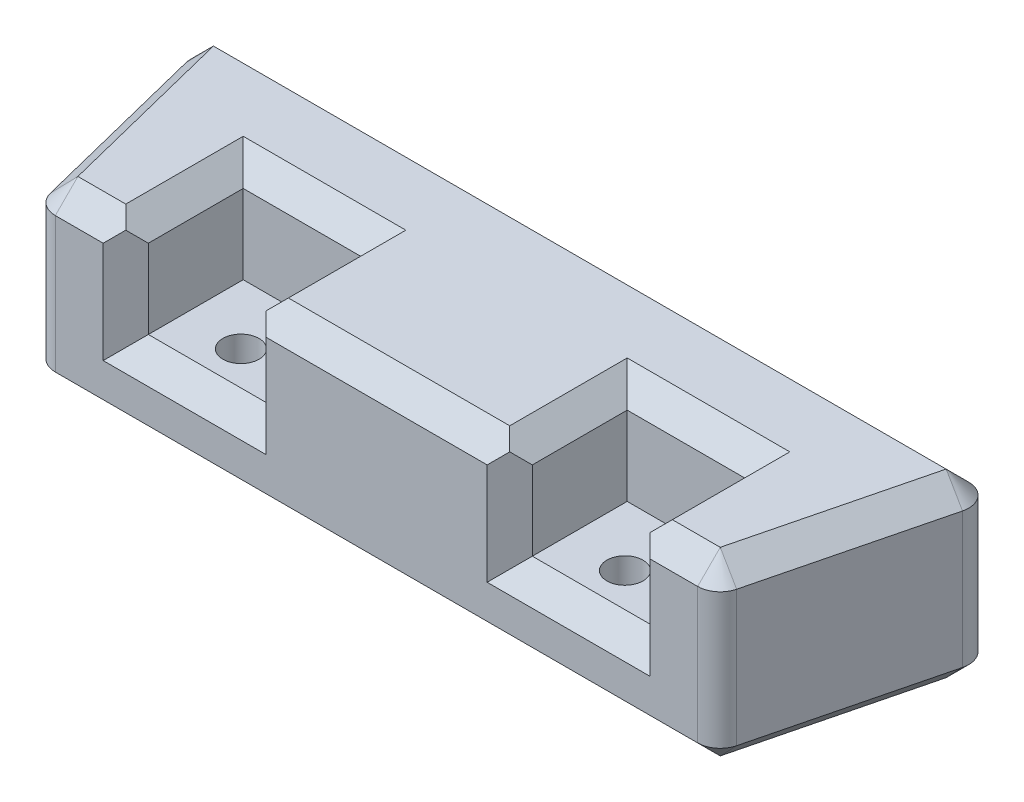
ISO-10303-21;
HEADER;
FILE_DESCRIPTION(('STEP AP214'),'2;1');
FILE_NAME('part.step','',(''),(''),'','','');
FILE_SCHEMA(('AUTOMOTIVE_DESIGN { 1 0 10303 214 1 1 1 1 }'));
ENDSEC;
DATA;
#1=APPLICATION_CONTEXT('core data for automotive mechanical design processes');
#2=APPLICATION_PROTOCOL_DEFINITION('international standard','automotive_design',2000,#1);
#3=PRODUCT_CONTEXT('',#1,'mechanical');
#4=PRODUCT('Part','Part','',(#3));
#5=PRODUCT_RELATED_PRODUCT_CATEGORY('part','',(#4));
#6=PRODUCT_DEFINITION_FORMATION('','',#4);
#7=PRODUCT_DEFINITION_CONTEXT('part definition',#1,'design');
#8=PRODUCT_DEFINITION('design','',#6,#7);
#9=PRODUCT_DEFINITION_SHAPE('','',#8);
#10=(LENGTH_UNIT() NAMED_UNIT(*) SI_UNIT(.MILLI.,.METRE.));
#11=(NAMED_UNIT(*) PLANE_ANGLE_UNIT() SI_UNIT($,.RADIAN.));
#12=(NAMED_UNIT(*) SI_UNIT($,.STERADIAN.) SOLID_ANGLE_UNIT());
#13=UNCERTAINTY_MEASURE_WITH_UNIT(LENGTH_MEASURE(1.E-05),#10,'distance_accuracy_value','');
#14=(GEOMETRIC_REPRESENTATION_CONTEXT(3) GLOBAL_UNCERTAINTY_ASSIGNED_CONTEXT((#13)) GLOBAL_UNIT_ASSIGNED_CONTEXT((#10,
#11,#12)) REPRESENTATION_CONTEXT('',''));
#15=CARTESIAN_POINT('',(0.,0.,0.));
#16=DIRECTION('',(0.,0.,1.));
#17=DIRECTION('',(1.,0.,0.));
#18=AXIS2_PLACEMENT_3D('',#15,#16,#17);
#19=CARTESIAN_POINT('',(31.2192235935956,8.,-9.));
#20=DIRECTION('',(0.,-1.,0.));
#21=DIRECTION('',(0.,0.,-1.));
#22=AXIS2_PLACEMENT_3D('',#19,#20,#21);
#23=CYLINDRICAL_SURFACE('',#22,0.999999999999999);
#24=DIRECTION('',(0.,-1.,0.));
#25=VECTOR('',#24,1.);
#26=CARTESIAN_POINT('',(32.1893660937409,8.,-8.75746437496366));
#27=LINE('',#26,#25);
#28=CARTESIAN_POINT('',(32.1893660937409,7.00000000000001,-8.75746437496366));
#29=VERTEX_POINT('',#28);
#30=CARTESIAN_POINT('',(32.1893660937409,0.999999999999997,-8.75746437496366));
#31=VERTEX_POINT('',#30);
#32=EDGE_CURVE('E277',#29,#31,#27,.T.);
#33=ORIENTED_EDGE('',*,*,#32,.T.);
#34=CARTESIAN_POINT('',(31.2192235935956,0.999999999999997,-9.));
#35=DIRECTION('',(0.,1.,0.));
#36=DIRECTION('',(0.,0.,1.));
#37=AXIS2_PLACEMENT_3D('',#34,#35,#36);
#38=CIRCLE('',#37,0.999999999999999);
#39=CARTESIAN_POINT('',(31.2192235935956,0.999999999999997,-10.));
#40=VERTEX_POINT('',#39);
#41=EDGE_CURVE('E500',#31,#40,#38,.T.);
#42=ORIENTED_EDGE('',*,*,#41,.T.);
#43=DIRECTION('',(0.,-1.,0.));
#44=VECTOR('',#43,1.);
#45=CARTESIAN_POINT('',(31.2192235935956,8.,-10.));
#46=LINE('',#45,#44);
#47=CARTESIAN_POINT('',(31.2192235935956,7.00000000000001,-10.));
#48=VERTEX_POINT('',#47);
#49=EDGE_CURVE('E329',#48,#40,#46,.T.);
#50=ORIENTED_EDGE('',*,*,#49,.F.);
#51=CARTESIAN_POINT('',(31.2192235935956,7.00000000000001,-9.));
#52=DIRECTION('',(0.,1.,0.));
#53=DIRECTION('',(0.,0.,1.));
#54=AXIS2_PLACEMENT_3D('',#51,#52,#53);
#55=CIRCLE('',#54,0.999999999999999);
#56=EDGE_CURVE('E408',#48,#29,#55,.F.);
#57=ORIENTED_EDGE('',*,*,#56,.T.);
#58=EDGE_LOOP('',(#33,#42,#50,#57));
#59=FACE_BOUND('',#58,.T.);
#60=ADVANCED_FACE('F47',(#59),#23,.T.);
#61=CARTESIAN_POINT('',(-1.21922359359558,8.,-10.));
#62=DIRECTION('',(0.,0.,1.));
#63=DIRECTION('',(1.,0.,0.));
#64=AXIS2_PLACEMENT_3D('',#61,#62,#63);
#65=PLANE('',#64);
#66=ORIENTED_EDGE('',*,*,#49,.T.);
#67=DIRECTION('',(-1.,0.,0.));
#68=VECTOR('',#67,1.);
#69=CARTESIAN_POINT('',(-1.21922359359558,0.999999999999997,-10.));
#70=LINE('',#69,#68);
#71=CARTESIAN_POINT('',(-1.21922359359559,0.999999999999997,-10.));
#72=VERTEX_POINT('',#71);
#73=EDGE_CURVE('E420',#40,#72,#70,.T.);
#74=ORIENTED_EDGE('',*,*,#73,.T.);
#75=DIRECTION('',(0.,-1.,0.));
#76=VECTOR('',#75,1.);
#77=CARTESIAN_POINT('',(-1.21922359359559,8.,-10.));
#78=LINE('',#77,#76);
#79=CARTESIAN_POINT('',(-1.21922359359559,7.00000000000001,-10.));
#80=VERTEX_POINT('',#79);
#81=EDGE_CURVE('E325',#80,#72,#78,.T.);
#82=ORIENTED_EDGE('',*,*,#81,.F.);
#83=DIRECTION('',(1.,0.,0.));
#84=VECTOR('',#83,1.);
#85=CARTESIAN_POINT('',(31.2192235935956,7.00000000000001,-10.));
#86=LINE('',#85,#84);
#87=EDGE_CURVE('E405',#80,#48,#86,.T.);
#88=ORIENTED_EDGE('',*,*,#87,.T.);
#89=EDGE_LOOP('',(#66,#74,#82,#88));
#90=FACE_BOUND('',#89,.T.);
#91=ADVANCED_FACE('F655',(#90),#65,.F.);
#92=CARTESIAN_POINT('',(-1.21922359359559,8.,-9.));
#93=DIRECTION('',(0.,-1.,0.));
#94=DIRECTION('',(0.,0.,-1.));
#95=AXIS2_PLACEMENT_3D('',#92,#93,#94);
#96=CYLINDRICAL_SURFACE('',#95,1.);
#97=ORIENTED_EDGE('',*,*,#81,.T.);
#98=CARTESIAN_POINT('',(-1.21922359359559,0.999999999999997,-9.));
#99=DIRECTION('',(0.,1.,0.));
#100=DIRECTION('',(0.,0.,1.));
#101=AXIS2_PLACEMENT_3D('',#98,#99,#100);
#102=CIRCLE('',#101,1.);
#103=CARTESIAN_POINT('',(-2.18936609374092,0.999999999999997,-8.75746437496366));
#104=VERTEX_POINT('',#103);
#105=EDGE_CURVE('E497',#72,#104,#102,.T.);
#106=ORIENTED_EDGE('',*,*,#105,.T.);
#107=DIRECTION('',(0.,-1.,0.));
#108=VECTOR('',#107,1.);
#109=CARTESIAN_POINT('',(-2.18936609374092,8.,-8.75746437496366));
#110=LINE('',#109,#108);
#111=CARTESIAN_POINT('',(-2.18936609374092,7.00000000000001,-8.75746437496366));
#112=VERTEX_POINT('',#111);
#113=EDGE_CURVE('E321',#112,#104,#110,.T.);
#114=ORIENTED_EDGE('',*,*,#113,.F.);
#115=CARTESIAN_POINT('',(-1.21922359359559,7.00000000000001,-9.));
#116=DIRECTION('',(0.,1.,0.));
#117=DIRECTION('',(0.,0.,1.));
#118=AXIS2_PLACEMENT_3D('',#115,#116,#117);
#119=CIRCLE('',#118,1.);
#120=EDGE_CURVE('E402',#112,#80,#119,.F.);
#121=ORIENTED_EDGE('',*,*,#120,.T.);
#122=EDGE_LOOP('',(#97,#106,#114,#121));
#123=FACE_BOUND('',#122,.T.);
#124=ADVANCED_FACE('F661',(#123),#96,.T.);
#125=CARTESIAN_POINT('',(-0.189366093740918,8.,-0.757464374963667));
#126=DIRECTION('',(0.970142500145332,0.,-0.242535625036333));
#127=DIRECTION('',(-0.242535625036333,0.,-0.970142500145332));
#128=AXIS2_PLACEMENT_3D('',#125,#126,#127);
#129=PLANE('',#128);
#130=ORIENTED_EDGE('',*,*,#113,.T.);
#131=DIRECTION('',(0.242535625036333,0.,0.970142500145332));
#132=VECTOR('',#131,1.);
#133=CARTESIAN_POINT('',(-0.189366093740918,0.999999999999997,-0.757464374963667));
#134=LINE('',#133,#132);
#135=CARTESIAN_POINT('',(-0.189366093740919,0.999999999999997,-0.757464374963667));
#136=VERTEX_POINT('',#135);
#137=EDGE_CURVE('E503',#104,#136,#134,.T.);
#138=ORIENTED_EDGE('',*,*,#137,.T.);
#139=DIRECTION('',(0.,-1.,0.));
#140=VECTOR('',#139,1.);
#141=CARTESIAN_POINT('',(-0.189366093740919,8.,-0.757464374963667));
#142=LINE('',#141,#140);
#143=CARTESIAN_POINT('',(-0.189366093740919,7.00000000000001,-0.757464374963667));
#144=VERTEX_POINT('',#143);
#145=EDGE_CURVE('E317',#144,#136,#142,.T.);
#146=ORIENTED_EDGE('',*,*,#145,.F.);
#147=DIRECTION('',(-0.242535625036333,0.,-0.970142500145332));
#148=VECTOR('',#147,1.);
#149=CARTESIAN_POINT('',(-2.18936609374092,7.00000000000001,-8.75746437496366));
#150=LINE('',#149,#148);
#151=EDGE_CURVE('E399',#144,#112,#150,.T.);
#152=ORIENTED_EDGE('',*,*,#151,.T.);
#153=EDGE_LOOP('',(#130,#138,#146,#152));
#154=FACE_BOUND('',#153,.T.);
#155=ADVANCED_FACE('F882',(#154),#129,.F.);
#156=CARTESIAN_POINT('',(0.780776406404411,8.,-1.));
#157=DIRECTION('',(0.,-1.,0.));
#158=DIRECTION('',(0.,0.,-1.));
#159=AXIS2_PLACEMENT_3D('',#156,#157,#158);
#160=CYLINDRICAL_SURFACE('',#159,0.999999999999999);
#161=ORIENTED_EDGE('',*,*,#145,.T.);
#162=CARTESIAN_POINT('',(0.780776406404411,0.999999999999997,-1.));
#163=DIRECTION('',(0.,1.,0.));
#164=DIRECTION('',(0.,0.,1.));
#165=AXIS2_PLACEMENT_3D('',#162,#163,#164);
#166=CIRCLE('',#165,0.999999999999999);
#167=CARTESIAN_POINT('',(0.78077640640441,0.999999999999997,0.));
#168=VERTEX_POINT('',#167);
#169=EDGE_CURVE('E506',#136,#168,#166,.T.);
#170=ORIENTED_EDGE('',*,*,#169,.T.);
#171=DIRECTION('',(0.,-1.,0.));
#172=VECTOR('',#171,1.);
#173=CARTESIAN_POINT('',(0.78077640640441,8.,0.));
#174=LINE('',#173,#172);
#175=CARTESIAN_POINT('',(0.78077640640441,7.00000000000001,0.));
#176=VERTEX_POINT('',#175);
#177=EDGE_CURVE('E313',#176,#168,#174,.T.);
#178=ORIENTED_EDGE('',*,*,#177,.F.);
#179=CARTESIAN_POINT('',(0.780776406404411,7.00000000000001,-1.));
#180=DIRECTION('',(0.,1.,0.));
#181=DIRECTION('',(0.,0.,1.));
#182=AXIS2_PLACEMENT_3D('',#179,#180,#181);
#183=CIRCLE('',#182,0.999999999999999);
#184=EDGE_CURVE('E396',#176,#144,#183,.F.);
#185=ORIENTED_EDGE('',*,*,#184,.T.);
#186=EDGE_LOOP('',(#161,#170,#178,#185));
#187=FACE_BOUND('',#186,.T.);
#188=ADVANCED_FACE('F878',(#187),#160,.T.);
#189=CARTESIAN_POINT('',(29.2192235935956,8.,0.));
#190=DIRECTION('',(0.,0.,-1.));
#191=DIRECTION('',(-1.,0.,0.));
#192=AXIS2_PLACEMENT_3D('',#189,#190,#191);
#193=PLANE('',#192);
#194=ORIENTED_EDGE('',*,*,#177,.T.);
#195=DIRECTION('',(1.,0.,0.));
#196=VECTOR('',#195,1.);
#197=CARTESIAN_POINT('',(29.2192235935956,0.999999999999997,0.));
#198=LINE('',#197,#196);
#199=CARTESIAN_POINT('',(29.2192235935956,0.999999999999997,0.));
#200=VERTEX_POINT('',#199);
#201=EDGE_CURVE('E533',#168,#200,#198,.T.);
#202=ORIENTED_EDGE('',*,*,#201,.T.);
#203=DIRECTION('',(0.,-1.,0.));
#204=VECTOR('',#203,1.);
#205=CARTESIAN_POINT('',(29.2192235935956,8.,0.));
#206=LINE('',#205,#204);
#207=CARTESIAN_POINT('',(29.2192235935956,7.00000000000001,0.));
#208=VERTEX_POINT('',#207);
#209=EDGE_CURVE('E309',#208,#200,#206,.T.);
#210=ORIENTED_EDGE('',*,*,#209,.F.);
#211=DIRECTION('',(-1.,0.,0.));
#212=VECTOR('',#211,1.);
#213=CARTESIAN_POINT('',(26.1,7.00000000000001,0.));
#214=LINE('',#213,#212);
#215=CARTESIAN_POINT('',(27.1,7.00000000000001,0.));
#216=VERTEX_POINT('',#215);
#217=EDGE_CURVE('E376',#208,#216,#214,.T.);
#218=ORIENTED_EDGE('',*,*,#217,.T.);
#219=DIRECTION('',(0.,-1.,0.));
#220=VECTOR('',#219,1.);
#221=CARTESIAN_POINT('',(27.1,8.,0.));
#222=LINE('',#221,#220);
#223=CARTESIAN_POINT('',(27.1,2.5,0.));
#224=VERTEX_POINT('',#223);
#225=EDGE_CURVE('E530',#216,#224,#222,.T.);
#226=ORIENTED_EDGE('',*,*,#225,.T.);
#227=DIRECTION('',(-1.,0.,0.));
#228=VECTOR('',#227,1.);
#229=CARTESIAN_POINT('',(20.9,2.5,0.));
#230=LINE('',#229,#228);
#231=CARTESIAN_POINT('',(19.9,2.5,0.));
#232=VERTEX_POINT('',#231);
#233=EDGE_CURVE('E527',#224,#232,#230,.T.);
#234=ORIENTED_EDGE('',*,*,#233,.T.);
#235=DIRECTION('',(0.,1.,0.));
#236=VECTOR('',#235,1.);
#237=CARTESIAN_POINT('',(19.9,8.,0.));
#238=LINE('',#237,#236);
#239=CARTESIAN_POINT('',(19.9,7.00000000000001,0.));
#240=VERTEX_POINT('',#239);
#241=EDGE_CURVE('E524',#232,#240,#238,.T.);
#242=ORIENTED_EDGE('',*,*,#241,.T.);
#243=DIRECTION('',(-1.,0.,0.));
#244=VECTOR('',#243,1.);
#245=CARTESIAN_POINT('',(9.1,7.00000000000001,0.));
#246=LINE('',#245,#244);
#247=CARTESIAN_POINT('',(10.1,7.00000000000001,0.));
#248=VERTEX_POINT('',#247);
#249=EDGE_CURVE('E383',#240,#248,#246,.T.);
#250=ORIENTED_EDGE('',*,*,#249,.T.);
#251=DIRECTION('',(0.,-1.,0.));
#252=VECTOR('',#251,1.);
#253=CARTESIAN_POINT('',(10.1,8.,0.));
#254=LINE('',#253,#252);
#255=CARTESIAN_POINT('',(10.1,2.5,0.));
#256=VERTEX_POINT('',#255);
#257=EDGE_CURVE('E521',#248,#256,#254,.T.);
#258=ORIENTED_EDGE('',*,*,#257,.T.);
#259=DIRECTION('',(-1.,0.,0.));
#260=VECTOR('',#259,1.);
#261=CARTESIAN_POINT('',(3.9,2.5,0.));
#262=LINE('',#261,#260);
#263=CARTESIAN_POINT('',(2.9,2.5,0.));
#264=VERTEX_POINT('',#263);
#265=EDGE_CURVE('E518',#256,#264,#262,.T.);
#266=ORIENTED_EDGE('',*,*,#265,.T.);
#267=DIRECTION('',(0.,1.,0.));
#268=VECTOR('',#267,1.);
#269=CARTESIAN_POINT('',(2.9,8.,0.));
#270=LINE('',#269,#268);
#271=CARTESIAN_POINT('',(2.9,7.00000000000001,0.));
#272=VERTEX_POINT('',#271);
#273=EDGE_CURVE('E515',#264,#272,#270,.T.);
#274=ORIENTED_EDGE('',*,*,#273,.T.);
#275=DIRECTION('',(-1.,0.,0.));
#276=VECTOR('',#275,1.);
#277=CARTESIAN_POINT('',(0.78077640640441,7.00000000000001,0.));
#278=LINE('',#277,#276);
#279=EDGE_CURVE('E380',#272,#176,#278,.T.);
#280=ORIENTED_EDGE('',*,*,#279,.T.);
#281=EDGE_LOOP('',(#194,#202,#210,#218,#226,#234,#242,#250,#258,#266,#274,#280));
#282=FACE_BOUND('',#281,.T.);
#283=ADVANCED_FACE('F870',(#282),#193,.F.);
#284=CARTESIAN_POINT('',(29.2192235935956,8.,-1.));
#285=DIRECTION('',(0.,-1.,0.));
#286=DIRECTION('',(0.,0.,-1.));
#287=AXIS2_PLACEMENT_3D('',#284,#285,#286);
#288=CYLINDRICAL_SURFACE('',#287,0.999999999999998);
#289=ORIENTED_EDGE('',*,*,#209,.T.);
#290=CARTESIAN_POINT('',(29.2192235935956,0.999999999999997,-1.));
#291=DIRECTION('',(0.,1.,0.));
#292=DIRECTION('',(0.,0.,1.));
#293=AXIS2_PLACEMENT_3D('',#290,#291,#292);
#294=CIRCLE('',#293,0.999999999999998);
#295=CARTESIAN_POINT('',(30.1893660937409,0.999999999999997,-0.757464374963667));
#296=VERTEX_POINT('',#295);
#297=EDGE_CURVE('E512',#200,#296,#294,.T.);
#298=ORIENTED_EDGE('',*,*,#297,.T.);
#299=DIRECTION('',(0.,-1.,0.));
#300=VECTOR('',#299,1.);
#301=CARTESIAN_POINT('',(30.1893660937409,8.,-0.757464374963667));
#302=LINE('',#301,#300);
#303=CARTESIAN_POINT('',(30.1893660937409,7.00000000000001,-0.757464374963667));
#304=VERTEX_POINT('',#303);
#305=EDGE_CURVE('E282',#304,#296,#302,.T.);
#306=ORIENTED_EDGE('',*,*,#305,.F.);
#307=CARTESIAN_POINT('',(29.2192235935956,7.00000000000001,-1.));
#308=DIRECTION('',(0.,1.,0.));
#309=DIRECTION('',(0.,0.,1.));
#310=AXIS2_PLACEMENT_3D('',#307,#308,#309);
#311=CIRCLE('',#310,0.999999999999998);
#312=EDGE_CURVE('E414',#304,#208,#311,.F.);
#313=ORIENTED_EDGE('',*,*,#312,.T.);
#314=EDGE_LOOP('',(#289,#298,#306,#313));
#315=FACE_BOUND('',#314,.T.);
#316=ADVANCED_FACE('F911',(#315),#288,.T.);
#317=CARTESIAN_POINT('',(32.1893660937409,8.,-8.75746437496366));
#318=DIRECTION('',(-0.970142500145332,0.,-0.242535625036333));
#319=DIRECTION('',(-0.242535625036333,0.,0.970142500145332));
#320=AXIS2_PLACEMENT_3D('',#317,#318,#319);
#321=PLANE('',#320);
#322=ORIENTED_EDGE('',*,*,#305,.T.);
#323=DIRECTION('',(0.242535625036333,0.,-0.970142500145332));
#324=VECTOR('',#323,1.);
#325=CARTESIAN_POINT('',(32.1893660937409,0.999999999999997,-8.75746437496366));
#326=LINE('',#325,#324);
#327=EDGE_CURVE('E509',#296,#31,#326,.T.);
#328=ORIENTED_EDGE('',*,*,#327,.T.);
#329=ORIENTED_EDGE('',*,*,#32,.F.);
#330=DIRECTION('',(-0.242535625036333,0.,0.970142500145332));
#331=VECTOR('',#330,1.);
#332=CARTESIAN_POINT('',(30.1893660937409,7.00000000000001,-0.757464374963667));
#333=LINE('',#332,#331);
#334=EDGE_CURVE('E411',#29,#304,#333,.T.);
#335=ORIENTED_EDGE('',*,*,#334,.T.);
#336=EDGE_LOOP('',(#322,#328,#329,#335));
#337=FACE_BOUND('',#336,.T.);
#338=ADVANCED_FACE('F914',(#337),#321,.F.);
#339=CARTESIAN_POINT('',(31.2192235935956,8.,-9.));
#340=DIRECTION('',(0.,1.,0.));
#341=DIRECTION('',(0.,0.,1.));
#342=AXIS2_PLACEMENT_3D('',#339,#340,#341);
#343=PLANE('',#342);
#344=DIRECTION('',(0.,0.,-1.));
#345=VECTOR('',#344,1.);
#346=CARTESIAN_POINT('',(19.9,8.,-5.2));
#347=LINE('',#346,#345);
#348=CARTESIAN_POINT('',(19.9,8.,-0.999999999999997));
#349=VERTEX_POINT('',#348);
#350=CARTESIAN_POINT('',(19.9,8.,-6.2));
#351=VERTEX_POINT('',#350);
#352=EDGE_CURVE('E366',#349,#351,#347,.T.);
#353=ORIENTED_EDGE('',*,*,#352,.T.);
#354=DIRECTION('',(1.,0.,0.));
#355=VECTOR('',#354,1.);
#356=CARTESIAN_POINT('',(26.1,8.,-6.2));
#357=LINE('',#356,#355);
#358=CARTESIAN_POINT('',(27.1,8.,-6.2));
#359=VERTEX_POINT('',#358);
#360=EDGE_CURVE('E369',#351,#359,#357,.T.);
#361=ORIENTED_EDGE('',*,*,#360,.T.);
#362=DIRECTION('',(0.,0.,1.));
#363=VECTOR('',#362,1.);
#364=CARTESIAN_POINT('',(27.1,8.,0.));
#365=LINE('',#364,#363);
#366=CARTESIAN_POINT('',(27.1,8.,-0.999999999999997));
#367=VERTEX_POINT('',#366);
#368=EDGE_CURVE('E335',#359,#367,#365,.T.);
#369=ORIENTED_EDGE('',*,*,#368,.T.);
#370=DIRECTION('',(1.,0.,0.));
#371=VECTOR('',#370,1.);
#372=CARTESIAN_POINT('',(29.2192235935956,8.,-0.999999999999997));
#373=LINE('',#372,#371);
#374=CARTESIAN_POINT('',(29.2192235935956,8.,-0.999999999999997));
#375=VERTEX_POINT('',#374);
#376=EDGE_CURVE('E339',#367,#375,#373,.T.);
#377=ORIENTED_EDGE('',*,*,#376,.T.);
#378=DIRECTION('',(0.242535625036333,0.,-0.970142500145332));
#379=VECTOR('',#378,1.);
#380=CARTESIAN_POINT('',(31.2192235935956,8.,-8.99999999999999));
#381=LINE('',#380,#379);
#382=CARTESIAN_POINT('',(31.2192235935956,8.,-9.));
#383=VERTEX_POINT('',#382);
#384=EDGE_CURVE('E342',#375,#383,#381,.T.);
#385=ORIENTED_EDGE('',*,*,#384,.T.);
#386=DIRECTION('',(-1.,0.,0.));
#387=VECTOR('',#386,1.);
#388=CARTESIAN_POINT('',(-1.21922359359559,8.,-9.));
#389=LINE('',#388,#387);
#390=CARTESIAN_POINT('',(-1.21922359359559,8.,-9.));
#391=VERTEX_POINT('',#390);
#392=EDGE_CURVE('E345',#383,#391,#389,.T.);
#393=ORIENTED_EDGE('',*,*,#392,.T.);
#394=DIRECTION('',(0.242535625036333,0.,0.970142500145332));
#395=VECTOR('',#394,1.);
#396=CARTESIAN_POINT('',(0.780776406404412,8.,-1.));
#397=LINE('',#396,#395);
#398=CARTESIAN_POINT('',(0.780776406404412,8.,-1.));
#399=VERTEX_POINT('',#398);
#400=EDGE_CURVE('E348',#391,#399,#397,.T.);
#401=ORIENTED_EDGE('',*,*,#400,.T.);
#402=DIRECTION('',(1.,0.,0.));
#403=VECTOR('',#402,1.);
#404=CARTESIAN_POINT('',(3.9,8.,-0.999999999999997));
#405=LINE('',#404,#403);
#406=CARTESIAN_POINT('',(2.9,8.,-0.999999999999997));
#407=VERTEX_POINT('',#406);
#408=EDGE_CURVE('E351',#399,#407,#405,.T.);
#409=ORIENTED_EDGE('',*,*,#408,.T.);
#410=DIRECTION('',(0.,0.,-1.));
#411=VECTOR('',#410,1.);
#412=CARTESIAN_POINT('',(2.9,8.,-5.2));
#413=LINE('',#412,#411);
#414=CARTESIAN_POINT('',(2.9,8.,-6.2));
#415=VERTEX_POINT('',#414);
#416=EDGE_CURVE('E354',#407,#415,#413,.T.);
#417=ORIENTED_EDGE('',*,*,#416,.T.);
#418=DIRECTION('',(1.,0.,0.));
#419=VECTOR('',#418,1.);
#420=CARTESIAN_POINT('',(9.1,8.,-6.2));
#421=LINE('',#420,#419);
#422=CARTESIAN_POINT('',(10.1,8.,-6.2));
#423=VERTEX_POINT('',#422);
#424=EDGE_CURVE('E357',#415,#423,#421,.T.);
#425=ORIENTED_EDGE('',*,*,#424,.T.);
#426=DIRECTION('',(0.,0.,1.));
#427=VECTOR('',#426,1.);
#428=CARTESIAN_POINT('',(10.1,8.,0.));
#429=LINE('',#428,#427);
#430=CARTESIAN_POINT('',(10.1,8.,-0.999999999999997));
#431=VERTEX_POINT('',#430);
#432=EDGE_CURVE('E360',#423,#431,#429,.T.);
#433=ORIENTED_EDGE('',*,*,#432,.T.);
#434=DIRECTION('',(1.,0.,0.));
#435=VECTOR('',#434,1.);
#436=CARTESIAN_POINT('',(20.9,8.,-0.999999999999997));
#437=LINE('',#436,#435);
#438=EDGE_CURVE('E363',#431,#349,#437,.T.);
#439=ORIENTED_EDGE('',*,*,#438,.T.);
#440=EDGE_LOOP('',(#353,#361,#369,#377,#385,#393,#401,#409,#417,#425,#433,#439));
#441=FACE_BOUND('',#440,.T.);
#442=ADVANCED_FACE('F939',(#441),#343,.T.);
#443=CARTESIAN_POINT('',(31.2192235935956,0.,-9.));
#444=DIRECTION('',(0.,1.,0.));
#445=DIRECTION('',(0.,0.,1.));
#446=AXIS2_PLACEMENT_3D('',#443,#444,#445);
#447=PLANE('',#446);
#448=CARTESIAN_POINT('',(23.5,0.,-2.5));
#449=DIRECTION('',(0.,1.,0.));
#450=DIRECTION('',(0.,0.,1.));
#451=AXIS2_PLACEMENT_3D('',#448,#449,#450);
#452=CIRCLE('',#451,0.799999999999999);
#453=CARTESIAN_POINT('',(23.5,0.,-1.7));
#454=VERTEX_POINT('',#453);
#455=EDGE_CURVE('E628',#454,#454,#452,.T.);
#456=ORIENTED_EDGE('',*,*,#455,.T.);
#457=EDGE_LOOP('',(#456));
#458=FACE_BOUND('',#457,.T.);
#459=CARTESIAN_POINT('',(6.5,0.,-2.5));
#460=DIRECTION('',(0.,1.,0.));
#461=DIRECTION('',(0.,0.,1.));
#462=AXIS2_PLACEMENT_3D('',#459,#460,#461);
#463=CIRCLE('',#462,0.799999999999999);
#464=CARTESIAN_POINT('',(6.5,0.,-1.7));
#465=VERTEX_POINT('',#464);
#466=EDGE_CURVE('E613',#465,#465,#463,.T.);
#467=ORIENTED_EDGE('',*,*,#466,.T.);
#468=EDGE_LOOP('',(#467));
#469=FACE_BOUND('',#468,.T.);
#470=DIRECTION('',(-0.242535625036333,0.,-0.970142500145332));
#471=VECTOR('',#470,1.);
#472=CARTESIAN_POINT('',(0.688920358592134,0.,-1.36742419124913));
#473=LINE('',#472,#471);
#474=CARTESIAN_POINT('',(0.780776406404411,0.,-1.));
#475=VERTEX_POINT('',#474);
#476=CARTESIAN_POINT('',(-1.21922359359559,0.,-9.));
#477=VERTEX_POINT('',#476);
#478=EDGE_CURVE('E490',#475,#477,#473,.T.);
#479=ORIENTED_EDGE('',*,*,#478,.T.);
#480=DIRECTION('',(1.,0.,0.));
#481=VECTOR('',#480,1.);
#482=CARTESIAN_POINT('',(31.2192235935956,0.,-9.));
#483=LINE('',#482,#481);
#484=CARTESIAN_POINT('',(31.2192235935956,0.,-9.));
#485=VERTEX_POINT('',#484);
#486=EDGE_CURVE('E493',#477,#485,#483,.T.);
#487=ORIENTED_EDGE('',*,*,#486,.T.);
#488=DIRECTION('',(-0.242535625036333,0.,0.970142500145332));
#489=VECTOR('',#488,1.);
#490=CARTESIAN_POINT('',(31.2192235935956,0.,-9.));
#491=LINE('',#490,#489);
#492=CARTESIAN_POINT('',(29.2192235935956,0.,-1.));
#493=VERTEX_POINT('',#492);
#494=EDGE_CURVE('E487',#485,#493,#491,.T.);
#495=ORIENTED_EDGE('',*,*,#494,.T.);
#496=DIRECTION('',(-1.,0.,0.));
#497=VECTOR('',#496,1.);
#498=CARTESIAN_POINT('',(31.2192235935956,0.,-1.));
#499=LINE('',#498,#497);
#500=EDGE_CURVE('E484',#493,#475,#499,.T.);
#501=ORIENTED_EDGE('',*,*,#500,.T.);
#502=EDGE_LOOP('',(#479,#487,#495,#501));
#503=FACE_BOUND('',#502,.T.);
#504=ADVANCED_FACE('F952',(#458,#469,#503),#447,.F.);
#505=CARTESIAN_POINT('',(3.9,-7.3539105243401,0.));
#506=DIRECTION('',(-1.,0.,0.));
#507=DIRECTION('',(0.,0.,1.));
#508=AXIS2_PLACEMENT_3D('',#505,#506,#507);
#509=PLANE('',#508);
#510=DIRECTION('',(0.,0.,1.));
#511=VECTOR('',#510,1.);
#512=CARTESIAN_POINT('',(3.9,7.00000000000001,0.));
#513=LINE('',#512,#511);
#514=CARTESIAN_POINT('',(3.9,7.00000000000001,-5.2));
#515=VERTEX_POINT('',#514);
#516=CARTESIAN_POINT('',(3.9,7.00000000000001,-1.));
#517=VERTEX_POINT('',#516);
#518=EDGE_CURVE('E393',#515,#517,#513,.T.);
#519=ORIENTED_EDGE('',*,*,#518,.T.);
#520=DIRECTION('',(0.,-1.,0.));
#521=VECTOR('',#520,1.);
#522=CARTESIAN_POINT('',(3.9,-7.3539105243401,-1.));
#523=LINE('',#522,#521);
#524=CARTESIAN_POINT('',(3.9,3.5,-1.));
#525=VERTEX_POINT('',#524);
#526=EDGE_CURVE('E12',#517,#525,#523,.T.);
#527=ORIENTED_EDGE('',*,*,#526,.T.);
#528=DIRECTION('',(0.,0.,-1.));
#529=VECTOR('',#528,1.);
#530=CARTESIAN_POINT('',(3.9,3.5,0.));
#531=LINE('',#530,#529);
#532=CARTESIAN_POINT('',(3.9,3.5,-5.2));
#533=VERTEX_POINT('',#532);
#534=EDGE_CURVE('E295',#525,#533,#531,.T.);
#535=ORIENTED_EDGE('',*,*,#534,.T.);
#536=DIRECTION('',(0.,1.,0.));
#537=VECTOR('',#536,1.);
#538=CARTESIAN_POINT('',(3.9,-7.3539105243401,-5.2));
#539=LINE('',#538,#537);
#540=EDGE_CURVE('E292',#533,#515,#539,.T.);
#541=ORIENTED_EDGE('',*,*,#540,.T.);
#542=EDGE_LOOP('',(#519,#527,#535,#541));
#543=FACE_BOUND('',#542,.T.);
#544=ADVANCED_FACE('F954',(#543),#509,.F.);
#545=CARTESIAN_POINT('',(9.1,-7.3539105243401,-5.2));
#546=DIRECTION('',(0.,0.,-1.));
#547=DIRECTION('',(-1.,0.,0.));
#548=AXIS2_PLACEMENT_3D('',#545,#546,#547);
#549=PLANE('',#548);
#550=DIRECTION('',(0.,1.,0.));
#551=VECTOR('',#550,1.);
#552=CARTESIAN_POINT('',(9.1,-7.3539105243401,-5.2));
#553=LINE('',#552,#551);
#554=CARTESIAN_POINT('',(9.1,3.5,-5.2));
#555=VERTEX_POINT('',#554);
#556=CARTESIAN_POINT('',(9.1,7.00000000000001,-5.2));
#557=VERTEX_POINT('',#556);
#558=EDGE_CURVE('E301',#555,#557,#553,.T.);
#559=ORIENTED_EDGE('',*,*,#558,.T.);
#560=DIRECTION('',(-1.,0.,0.));
#561=VECTOR('',#560,1.);
#562=CARTESIAN_POINT('',(3.9,7.00000000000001,-5.2));
#563=LINE('',#562,#561);
#564=EDGE_CURVE('E390',#557,#515,#563,.T.);
#565=ORIENTED_EDGE('',*,*,#564,.T.);
#566=ORIENTED_EDGE('',*,*,#540,.F.);
#567=DIRECTION('',(1.,0.,0.));
#568=VECTOR('',#567,1.);
#569=CARTESIAN_POINT('',(9.1,3.5,-5.2));
#570=LINE('',#569,#568);
#571=EDGE_CURVE('E291',#533,#555,#570,.T.);
#572=ORIENTED_EDGE('',*,*,#571,.T.);
#573=EDGE_LOOP('',(#559,#565,#566,#572));
#574=FACE_BOUND('',#573,.T.);
#575=ADVANCED_FACE('F961',(#574),#549,.F.);
#576=CARTESIAN_POINT('',(9.1,-7.3539105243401,0.));
#577=DIRECTION('',(1.,0.,0.));
#578=DIRECTION('',(0.,0.,-1.));
#579=AXIS2_PLACEMENT_3D('',#576,#577,#578);
#580=PLANE('',#579);
#581=DIRECTION('',(0.,0.,1.));
#582=VECTOR('',#581,1.);
#583=CARTESIAN_POINT('',(9.1,3.5,0.));
#584=LINE('',#583,#582);
#585=CARTESIAN_POINT('',(9.1,3.5,-1.));
#586=VERTEX_POINT('',#585);
#587=EDGE_CURVE('E287',#555,#586,#584,.T.);
#588=ORIENTED_EDGE('',*,*,#587,.T.);
#589=DIRECTION('',(0.,1.,0.));
#590=VECTOR('',#589,1.);
#591=CARTESIAN_POINT('',(9.1,-7.3539105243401,-1.));
#592=LINE('',#591,#590);
#593=CARTESIAN_POINT('',(9.1,7.00000000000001,-1.));
#594=VERTEX_POINT('',#593);
#595=EDGE_CURVE('E560',#586,#594,#592,.T.);
#596=ORIENTED_EDGE('',*,*,#595,.T.);
#597=DIRECTION('',(0.,0.,-1.));
#598=VECTOR('',#597,1.);
#599=CARTESIAN_POINT('',(9.1,7.00000000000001,-5.2));
#600=LINE('',#599,#598);
#601=EDGE_CURVE('E387',#594,#557,#600,.T.);
#602=ORIENTED_EDGE('',*,*,#601,.T.);
#603=ORIENTED_EDGE('',*,*,#558,.F.);
#604=EDGE_LOOP('',(#588,#596,#602,#603));
#605=FACE_BOUND('',#604,.T.);
#606=ADVANCED_FACE('F1015',(#605),#580,.F.);
#607=CARTESIAN_POINT('',(31.2192235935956,3.5,-9.));
#608=DIRECTION('',(0.,1.,0.));
#609=DIRECTION('',(0.,0.,1.));
#610=AXIS2_PLACEMENT_3D('',#607,#608,#609);
#611=PLANE('',#610);
#612=CARTESIAN_POINT('',(6.5,3.5,-2.5));
#613=DIRECTION('',(0.,1.,0.));
#614=DIRECTION('',(0.,0.,1.));
#615=AXIS2_PLACEMENT_3D('',#612,#613,#614);
#616=CIRCLE('',#615,0.799999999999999);
#617=CARTESIAN_POINT('',(6.5,3.5,-1.7));
#618=VERTEX_POINT('',#617);
#619=EDGE_CURVE('E622',#618,#618,#616,.T.);
#620=ORIENTED_EDGE('',*,*,#619,.F.);
#621=EDGE_LOOP('',(#620));
#622=FACE_BOUND('',#621,.T.);
#623=ORIENTED_EDGE('',*,*,#534,.F.);
#624=DIRECTION('',(1.,0.,0.));
#625=VECTOR('',#624,1.);
#626=CARTESIAN_POINT('',(9.1,3.5,-1.));
#627=LINE('',#626,#625);
#628=EDGE_CURVE('E567',#525,#586,#627,.T.);
#629=ORIENTED_EDGE('',*,*,#628,.T.);
#630=ORIENTED_EDGE('',*,*,#587,.F.);
#631=ORIENTED_EDGE('',*,*,#571,.F.);
#632=EDGE_LOOP('',(#623,#629,#630,#631));
#633=FACE_BOUND('',#632,.T.);
#634=ADVANCED_FACE('F1178',(#622,#633),#611,.T.);
#635=CARTESIAN_POINT('',(26.1,-7.3539105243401,0.));
#636=DIRECTION('',(1.,0.,0.));
#637=DIRECTION('',(0.,0.,-1.));
#638=AXIS2_PLACEMENT_3D('',#635,#636,#637);
#639=PLANE('',#638);
#640=DIRECTION('',(0.,0.,1.));
#641=VECTOR('',#640,1.);
#642=CARTESIAN_POINT('',(26.1,3.5,0.));
#643=LINE('',#642,#641);
#644=CARTESIAN_POINT('',(26.1,3.5,-5.2));
#645=VERTEX_POINT('',#644);
#646=CARTESIAN_POINT('',(26.1,3.5,-1.));
#647=VERTEX_POINT('',#646);
#648=EDGE_CURVE('E260',#645,#647,#643,.T.);
#649=ORIENTED_EDGE('',*,*,#648,.T.);
#650=DIRECTION('',(0.,1.,0.));
#651=VECTOR('',#650,1.);
#652=CARTESIAN_POINT('',(26.1,-7.3539105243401,-1.));
#653=LINE('',#652,#651);
#654=CARTESIAN_POINT('',(26.1,7.00000000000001,-1.));
#655=VERTEX_POINT('',#654);
#656=EDGE_CURVE('E536',#647,#655,#653,.T.);
#657=ORIENTED_EDGE('',*,*,#656,.T.);
#658=DIRECTION('',(0.,0.,-1.));
#659=VECTOR('',#658,1.);
#660=CARTESIAN_POINT('',(26.1,7.00000000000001,-5.2));
#661=LINE('',#660,#659);
#662=CARTESIAN_POINT('',(26.1,7.00000000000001,-5.2));
#663=VERTEX_POINT('',#662);
#664=EDGE_CURVE('E417',#655,#663,#661,.T.);
#665=ORIENTED_EDGE('',*,*,#664,.T.);
#666=DIRECTION('',(0.,1.,0.));
#667=VECTOR('',#666,1.);
#668=CARTESIAN_POINT('',(26.1,-7.3539105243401,-5.2));
#669=LINE('',#668,#667);
#670=EDGE_CURVE('E271',#645,#663,#669,.T.);
#671=ORIENTED_EDGE('',*,*,#670,.F.);
#672=EDGE_LOOP('',(#649,#657,#665,#671));
#673=FACE_BOUND('',#672,.T.);
#674=ADVANCED_FACE('F1184',(#673),#639,.F.);
#675=CARTESIAN_POINT('',(20.9,-7.3539105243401,0.));
#676=DIRECTION('',(-1.,0.,0.));
#677=DIRECTION('',(0.,0.,1.));
#678=AXIS2_PLACEMENT_3D('',#675,#676,#677);
#679=PLANE('',#678);
#680=DIRECTION('',(0.,0.,1.));
#681=VECTOR('',#680,1.);
#682=CARTESIAN_POINT('',(20.9,7.00000000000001,0.));
#683=LINE('',#682,#681);
#684=CARTESIAN_POINT('',(20.9,7.00000000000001,-5.2));
#685=VERTEX_POINT('',#684);
#686=CARTESIAN_POINT('',(20.9,7.00000000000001,-1.));
#687=VERTEX_POINT('',#686);
#688=EDGE_CURVE('E373',#685,#687,#683,.T.);
#689=ORIENTED_EDGE('',*,*,#688,.T.);
#690=DIRECTION('',(0.,-1.,0.));
#691=VECTOR('',#690,1.);
#692=CARTESIAN_POINT('',(20.9,-7.3539105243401,-1.));
#693=LINE('',#692,#691);
#694=CARTESIAN_POINT('',(20.9,3.5,-1.));
#695=VERTEX_POINT('',#694);
#696=EDGE_CURVE('E255',#687,#695,#693,.T.);
#697=ORIENTED_EDGE('',*,*,#696,.T.);
#698=DIRECTION('',(0.,0.,-1.));
#699=VECTOR('',#698,1.);
#700=CARTESIAN_POINT('',(20.9,3.5,0.));
#701=LINE('',#700,#699);
#702=CARTESIAN_POINT('',(20.9,3.5,-5.2));
#703=VERTEX_POINT('',#702);
#704=EDGE_CURVE('E249',#695,#703,#701,.T.);
#705=ORIENTED_EDGE('',*,*,#704,.T.);
#706=DIRECTION('',(0.,1.,0.));
#707=VECTOR('',#706,1.);
#708=CARTESIAN_POINT('',(20.9,-7.3539105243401,-5.2));
#709=LINE('',#708,#707);
#710=EDGE_CURVE('E253',#703,#685,#709,.T.);
#711=ORIENTED_EDGE('',*,*,#710,.T.);
#712=EDGE_LOOP('',(#689,#697,#705,#711));
#713=FACE_BOUND('',#712,.T.);
#714=ADVANCED_FACE('F252',(#713),#679,.F.);
#715=CARTESIAN_POINT('',(20.9,-7.3539105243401,-5.2));
#716=DIRECTION('',(0.,0.,-1.));
#717=DIRECTION('',(-1.,0.,0.));
#718=AXIS2_PLACEMENT_3D('',#715,#716,#717);
#719=PLANE('',#718);
#720=ORIENTED_EDGE('',*,*,#670,.T.);
#721=DIRECTION('',(-1.,0.,0.));
#722=VECTOR('',#721,1.);
#723=CARTESIAN_POINT('',(20.9,7.00000000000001,-5.2));
#724=LINE('',#723,#722);
#725=EDGE_CURVE('E269',#663,#685,#724,.T.);
#726=ORIENTED_EDGE('',*,*,#725,.T.);
#727=ORIENTED_EDGE('',*,*,#710,.F.);
#728=DIRECTION('',(1.,0.,0.));
#729=VECTOR('',#728,1.);
#730=CARTESIAN_POINT('',(20.9,3.5,-5.2));
#731=LINE('',#730,#729);
#732=EDGE_CURVE('E266',#703,#645,#731,.T.);
#733=ORIENTED_EDGE('',*,*,#732,.T.);
#734=EDGE_LOOP('',(#720,#726,#727,#733));
#735=FACE_BOUND('',#734,.T.);
#736=ADVANCED_FACE('F265',(#735),#719,.F.);
#737=CARTESIAN_POINT('',(31.2192235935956,3.5,-9.));
#738=DIRECTION('',(0.,1.,0.));
#739=DIRECTION('',(0.,0.,1.));
#740=AXIS2_PLACEMENT_3D('',#737,#738,#739);
#741=PLANE('',#740);
#742=CARTESIAN_POINT('',(23.5,3.5,-2.5));
#743=DIRECTION('',(0.,1.,0.));
#744=DIRECTION('',(0.,0.,1.));
#745=AXIS2_PLACEMENT_3D('',#742,#743,#744);
#746=CIRCLE('',#745,0.799999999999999);
#747=CARTESIAN_POINT('',(23.5,3.5,-1.7));
#748=VERTEX_POINT('',#747);
#749=EDGE_CURVE('E634',#748,#748,#746,.T.);
#750=ORIENTED_EDGE('',*,*,#749,.F.);
#751=EDGE_LOOP('',(#750));
#752=FACE_BOUND('',#751,.T.);
#753=ORIENTED_EDGE('',*,*,#704,.F.);
#754=DIRECTION('',(1.,0.,0.));
#755=VECTOR('',#754,1.);
#756=CARTESIAN_POINT('',(26.1,3.5,-1.));
#757=LINE('',#756,#755);
#758=EDGE_CURVE('E546',#695,#647,#757,.T.);
#759=ORIENTED_EDGE('',*,*,#758,.T.);
#760=ORIENTED_EDGE('',*,*,#648,.F.);
#761=ORIENTED_EDGE('',*,*,#732,.F.);
#762=EDGE_LOOP('',(#753,#759,#760,#761));
#763=FACE_BOUND('',#762,.T.);
#764=ADVANCED_FACE('F273',(#752,#763),#741,.T.);
#765=CARTESIAN_POINT('',(0.688920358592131,8.,-1.36742419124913));
#766=DIRECTION('',(-0.685994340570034,0.707106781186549,0.171498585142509));
#767=DIRECTION('',(-0.242535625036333,0.,-0.970142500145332));
#768=AXIS2_PLACEMENT_3D('',#765,#766,#767);
#769=PLANE('',#768);
#770=DIRECTION('',(0.685994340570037,0.707106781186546,-0.171498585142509));
#771=VECTOR('',#770,1.);
#772=CARTESIAN_POINT('',(-2.18936609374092,7.00000000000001,-8.75746437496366));
#773=LINE('',#772,#771);
#774=EDGE_CURVE('E304',#112,#391,#773,.T.);
#775=ORIENTED_EDGE('',*,*,#774,.F.);
#776=ORIENTED_EDGE('',*,*,#151,.F.);
#777=DIRECTION('',(-0.685994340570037,-0.707106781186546,0.17149858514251));
#778=VECTOR('',#777,1.);
#779=CARTESIAN_POINT('',(0.780776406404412,8.,-1.));
#780=LINE('',#779,#778);
#781=EDGE_CURVE('E474',#399,#144,#780,.T.);
#782=ORIENTED_EDGE('',*,*,#781,.F.);
#783=ORIENTED_EDGE('',*,*,#400,.F.);
#784=EDGE_LOOP('',(#775,#776,#782,#783));
#785=FACE_BOUND('',#784,.T.);
#786=ADVANCED_FACE('F642',(#785),#769,.T.);
#787=CARTESIAN_POINT('',(-1.21922359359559,7.00000000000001,-9.));
#788=DIRECTION('',(0.,-1.,0.));
#789=DIRECTION('',(0.,0.,-1.));
#790=AXIS2_PLACEMENT_3D('',#787,#788,#789);
#791=CONICAL_SURFACE('',#790,0.999999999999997,0.78539816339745);
#792=ORIENTED_EDGE('',*,*,#120,.F.);
#793=ORIENTED_EDGE('',*,*,#774,.T.);
#794=DIRECTION('',(0.,0.707106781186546,0.707106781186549));
#795=VECTOR('',#794,1.);
#796=CARTESIAN_POINT('',(-1.21922359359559,7.00000000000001,-10.));
#797=LINE('',#796,#795);
#798=EDGE_CURVE('E470',#80,#391,#797,.T.);
#799=ORIENTED_EDGE('',*,*,#798,.F.);
#800=EDGE_LOOP('',(#792,#793,#799));
#801=FACE_BOUND('',#800,.T.);
#802=ADVANCED_FACE('F648',(#801),#791,.T.);
#803=CARTESIAN_POINT('',(0.780776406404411,7.00000000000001,-1.));
#804=DIRECTION('',(0.,-1.,0.));
#805=DIRECTION('',(0.,0.,-1.));
#806=AXIS2_PLACEMENT_3D('',#803,#804,#805);
#807=CONICAL_SURFACE('',#806,0.999999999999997,0.78539816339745);
#808=ORIENTED_EDGE('',*,*,#781,.T.);
#809=ORIENTED_EDGE('',*,*,#184,.F.);
#810=DIRECTION('',(0.,-0.707106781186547,0.707106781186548));
#811=VECTOR('',#810,1.);
#812=CARTESIAN_POINT('',(0.78077640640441,8.,-0.999999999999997));
#813=LINE('',#812,#811);
#814=EDGE_CURVE('E466',#399,#176,#813,.T.);
#815=ORIENTED_EDGE('',*,*,#814,.F.);
#816=EDGE_LOOP('',(#808,#809,#815));
#817=FACE_BOUND('',#816,.T.);
#818=ADVANCED_FACE('F757',(#817),#807,.T.);
#819=CARTESIAN_POINT('',(31.2192235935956,8.,-9.));
#820=DIRECTION('',(0.,0.707106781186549,-0.707106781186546));
#821=DIRECTION('',(1.,0.,0.));
#822=AXIS2_PLACEMENT_3D('',#819,#820,#821);
#823=PLANE('',#822);
#824=ORIENTED_EDGE('',*,*,#798,.T.);
#825=ORIENTED_EDGE('',*,*,#392,.F.);
#826=DIRECTION('',(0.,0.707106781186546,0.707106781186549));
#827=VECTOR('',#826,1.);
#828=CARTESIAN_POINT('',(31.2192235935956,7.00000000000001,-10.));
#829=LINE('',#828,#827);
#830=EDGE_CURVE('E462',#48,#383,#829,.T.);
#831=ORIENTED_EDGE('',*,*,#830,.F.);
#832=ORIENTED_EDGE('',*,*,#87,.F.);
#833=EDGE_LOOP('',(#824,#825,#831,#832));
#834=FACE_BOUND('',#833,.T.);
#835=ADVANCED_FACE('F751',(#834),#823,.T.);
#836=CARTESIAN_POINT('',(31.2192235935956,8.,-0.999999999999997));
#837=DIRECTION('',(0.,0.707106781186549,0.707106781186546));
#838=DIRECTION('',(-1.,0.,0.));
#839=AXIS2_PLACEMENT_3D('',#836,#837,#838);
#840=PLANE('',#839);
#841=ORIENTED_EDGE('',*,*,#279,.F.);
#842=DIRECTION('',(-0.577350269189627,-0.577350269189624,0.577350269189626));
#843=VECTOR('',#842,1.);
#844=CARTESIAN_POINT('',(13.0064078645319,17.1064078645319,-10.1064078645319));
#845=LINE('',#844,#843);
#846=CARTESIAN_POINT('',(3.4,7.5,-0.5));
#847=VERTEX_POINT('',#846);
#848=EDGE_CURVE('E73',#272,#847,#845,.F.);
#849=ORIENTED_EDGE('',*,*,#848,.T.);
#850=DIRECTION('',(-0.577350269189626,0.577350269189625,-0.577350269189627));
#851=VECTOR('',#850,1.);
#852=CARTESIAN_POINT('',(12.3397411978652,-1.43974119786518,8.43974119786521));
#853=LINE('',#852,#851);
#854=EDGE_CURVE('E459',#407,#847,#853,.F.);
#855=ORIENTED_EDGE('',*,*,#854,.F.);
#856=ORIENTED_EDGE('',*,*,#408,.F.);
#857=ORIENTED_EDGE('',*,*,#814,.T.);
#858=EDGE_LOOP('',(#841,#849,#855,#856,#857));
#859=FACE_BOUND('',#858,.T.);
#860=ADVANCED_FACE('F744',(#859),#840,.T.);
#861=CARTESIAN_POINT('',(31.2192235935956,7.00000000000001,-9.));
#862=DIRECTION('',(0.,-1.,0.));
#863=DIRECTION('',(0.,0.,-1.));
#864=AXIS2_PLACEMENT_3D('',#861,#862,#863);
#865=CONICAL_SURFACE('',#864,0.999999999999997,0.78539816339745);
#866=ORIENTED_EDGE('',*,*,#56,.F.);
#867=ORIENTED_EDGE('',*,*,#830,.T.);
#868=DIRECTION('',(-0.685994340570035,0.707106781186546,-0.171498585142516));
#869=VECTOR('',#868,1.);
#870=CARTESIAN_POINT('',(32.1893660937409,7.00000000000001,-8.75746437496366));
#871=LINE('',#870,#869);
#872=EDGE_CURVE('E455',#29,#383,#871,.T.);
#873=ORIENTED_EDGE('',*,*,#872,.F.);
#874=EDGE_LOOP('',(#866,#867,#873));
#875=FACE_BOUND('',#874,.T.);
#876=ADVANCED_FACE('F738',(#875),#865,.T.);
#877=CARTESIAN_POINT('',(3.9,7.00000000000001,0.));
#878=DIRECTION('',(0.707106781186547,0.707106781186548,0.));
#879=DIRECTION('',(0.,0.,-1.));
#880=AXIS2_PLACEMENT_3D('',#877,#878,#879);
#881=PLANE('',#880);
#882=ORIENTED_EDGE('',*,*,#854,.T.);
#883=DIRECTION('',(-0.577350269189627,0.577350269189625,0.577350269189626));
#884=VECTOR('',#883,1.);
#885=CARTESIAN_POINT('',(3.56666666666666,7.33333333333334,-0.666666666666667));
#886=LINE('',#885,#884);
#887=EDGE_CURVE('E58',#847,#517,#886,.F.);
#888=ORIENTED_EDGE('',*,*,#887,.T.);
#889=ORIENTED_EDGE('',*,*,#518,.F.);
#890=DIRECTION('',(-0.577350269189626,0.577350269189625,-0.577350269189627));
#891=VECTOR('',#890,1.);
#892=CARTESIAN_POINT('',(5.63333333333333,5.26666666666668,-3.46666666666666));
#893=LINE('',#892,#891);
#894=EDGE_CURVE('E451',#415,#515,#893,.F.);
#895=ORIENTED_EDGE('',*,*,#894,.F.);
#896=ORIENTED_EDGE('',*,*,#416,.F.);
#897=EDGE_LOOP('',(#882,#888,#889,#895,#896));
#898=FACE_BOUND('',#897,.T.);
#899=ADVANCED_FACE('F731',(#898),#881,.T.);
#900=CARTESIAN_POINT('',(31.2192235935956,8.,-9.));
#901=DIRECTION('',(0.685994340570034,0.707106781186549,0.171498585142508));
#902=DIRECTION('',(-0.242535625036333,0.,0.970142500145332));
#903=AXIS2_PLACEMENT_3D('',#900,#901,#902);
#904=PLANE('',#903);
#905=ORIENTED_EDGE('',*,*,#872,.T.);
#906=ORIENTED_EDGE('',*,*,#384,.F.);
#907=DIRECTION('',(-0.685994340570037,0.707106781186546,-0.171498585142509));
#908=VECTOR('',#907,1.);
#909=CARTESIAN_POINT('',(30.1893660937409,7.00000000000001,-0.757464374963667));
#910=LINE('',#909,#908);
#911=EDGE_CURVE('E447',#304,#375,#910,.T.);
#912=ORIENTED_EDGE('',*,*,#911,.F.);
#913=ORIENTED_EDGE('',*,*,#334,.F.);
#914=EDGE_LOOP('',(#905,#906,#912,#913));
#915=FACE_BOUND('',#914,.T.);
#916=ADVANCED_FACE('F724',(#915),#904,.T.);
#917=CARTESIAN_POINT('',(9.1,7.00000000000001,-5.2));
#918=DIRECTION('',(0.,0.707106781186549,0.707106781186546));
#919=DIRECTION('',(1.,0.,0.));
#920=AXIS2_PLACEMENT_3D('',#917,#918,#919);
#921=PLANE('',#920);
#922=ORIENTED_EDGE('',*,*,#894,.T.);
#923=ORIENTED_EDGE('',*,*,#564,.F.);
#924=DIRECTION('',(0.577350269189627,0.577350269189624,-0.577350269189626));
#925=VECTOR('',#924,1.);
#926=CARTESIAN_POINT('',(7.36666666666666,5.26666666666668,-3.46666666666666));
#927=LINE('',#926,#925);
#928=EDGE_CURVE('E443',#423,#557,#927,.F.);
#929=ORIENTED_EDGE('',*,*,#928,.F.);
#930=ORIENTED_EDGE('',*,*,#424,.F.);
#931=EDGE_LOOP('',(#922,#923,#929,#930));
#932=FACE_BOUND('',#931,.T.);
#933=ADVANCED_FACE('F717',(#932),#921,.T.);
#934=CARTESIAN_POINT('',(29.2192235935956,7.00000000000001,-1.));
#935=DIRECTION('',(0.,-1.,0.));
#936=DIRECTION('',(0.,0.,-1.));
#937=AXIS2_PLACEMENT_3D('',#934,#935,#936);
#938=CONICAL_SURFACE('',#937,0.999999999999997,0.78539816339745);
#939=ORIENTED_EDGE('',*,*,#312,.F.);
#940=ORIENTED_EDGE('',*,*,#911,.T.);
#941=DIRECTION('',(0.,0.707106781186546,-0.707106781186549));
#942=VECTOR('',#941,1.);
#943=CARTESIAN_POINT('',(29.2192235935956,7.00000000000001,0.));
#944=LINE('',#943,#942);
#945=EDGE_CURVE('E439',#208,#375,#944,.T.);
#946=ORIENTED_EDGE('',*,*,#945,.F.);
#947=EDGE_LOOP('',(#939,#940,#946));
#948=FACE_BOUND('',#947,.T.);
#949=ADVANCED_FACE('F710',(#948),#938,.T.);
#950=CARTESIAN_POINT('',(9.1,7.00000000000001,0.));
#951=DIRECTION('',(-0.707106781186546,0.707106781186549,0.));
#952=DIRECTION('',(0.,0.,1.));
#953=AXIS2_PLACEMENT_3D('',#950,#951,#952);
#954=PLANE('',#953);
#955=ORIENTED_EDGE('',*,*,#601,.F.);
#956=DIRECTION('',(-0.577350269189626,-0.577350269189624,-0.577350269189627));
#957=VECTOR('',#956,1.);
#958=CARTESIAN_POINT('',(9.43333333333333,7.33333333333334,-0.666666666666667));
#959=LINE('',#958,#957);
#960=CARTESIAN_POINT('',(9.6,7.50000000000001,-0.5));
#961=VERTEX_POINT('',#960);
#962=EDGE_CURVE('E564',#594,#961,#959,.F.);
#963=ORIENTED_EDGE('',*,*,#962,.T.);
#964=DIRECTION('',(0.577350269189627,0.577350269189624,-0.577350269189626));
#965=VECTOR('',#964,1.);
#966=CARTESIAN_POINT('',(9.1,7.00000000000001,0.));
#967=LINE('',#966,#965);
#968=EDGE_CURVE('E435',#431,#961,#967,.F.);
#969=ORIENTED_EDGE('',*,*,#968,.F.);
#970=ORIENTED_EDGE('',*,*,#432,.F.);
#971=ORIENTED_EDGE('',*,*,#928,.T.);
#972=EDGE_LOOP('',(#955,#963,#969,#970,#971));
#973=FACE_BOUND('',#972,.T.);
#974=ADVANCED_FACE('F703',(#973),#954,.T.);
#975=CARTESIAN_POINT('',(31.2192235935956,8.,-0.999999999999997));
#976=DIRECTION('',(0.,0.707106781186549,0.707106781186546));
#977=DIRECTION('',(-1.,0.,0.));
#978=AXIS2_PLACEMENT_3D('',#975,#976,#977);
#979=PLANE('',#978);
#980=DIRECTION('',(0.577350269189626,0.577350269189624,-0.577350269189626));
#981=VECTOR('',#980,1.);
#982=CARTESIAN_POINT('',(26.1,7.00000000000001,0.));
#983=LINE('',#982,#981);
#984=CARTESIAN_POINT('',(26.6,7.5,-0.5));
#985=VERTEX_POINT('',#984);
#986=EDGE_CURVE('E432',#985,#367,#983,.T.);
#987=ORIENTED_EDGE('',*,*,#986,.F.);
#988=DIRECTION('',(-0.577350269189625,0.577350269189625,-0.577350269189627));
#989=VECTOR('',#988,1.);
#990=CARTESIAN_POINT('',(27.8064078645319,6.29359213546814,0.706407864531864));
#991=LINE('',#990,#989);
#992=EDGE_CURVE('E543',#985,#216,#991,.F.);
#993=ORIENTED_EDGE('',*,*,#992,.T.);
#994=ORIENTED_EDGE('',*,*,#217,.F.);
#995=ORIENTED_EDGE('',*,*,#945,.T.);
#996=ORIENTED_EDGE('',*,*,#376,.F.);
#997=EDGE_LOOP('',(#987,#993,#994,#995,#996));
#998=FACE_BOUND('',#997,.T.);
#999=ADVANCED_FACE('F696',(#998),#979,.T.);
#1000=CARTESIAN_POINT('',(31.2192235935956,8.,-0.999999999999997));
#1001=DIRECTION('',(0.,0.707106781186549,0.707106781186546));
#1002=DIRECTION('',(-1.,0.,0.));
#1003=AXIS2_PLACEMENT_3D('',#1000,#1001,#1002);
#1004=PLANE('',#1003);
#1005=ORIENTED_EDGE('',*,*,#249,.F.);
#1006=DIRECTION('',(-0.577350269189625,-0.577350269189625,0.577350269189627));
#1007=VECTOR('',#1006,1.);
#1008=CARTESIAN_POINT('',(24.3397411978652,11.4397411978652,-4.4397411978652));
#1009=LINE('',#1008,#1007);
#1010=CARTESIAN_POINT('',(20.4,7.5,-0.499999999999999));
#1011=VERTEX_POINT('',#1010);
#1012=EDGE_CURVE('E552',#240,#1011,#1009,.F.);
#1013=ORIENTED_EDGE('',*,*,#1012,.T.);
#1014=DIRECTION('',(-0.577350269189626,0.577350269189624,-0.577350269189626));
#1015=VECTOR('',#1014,1.);
#1016=CARTESIAN_POINT('',(23.6730745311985,4.22692546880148,2.77307453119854));
#1017=LINE('',#1016,#1015);
#1018=EDGE_CURVE('E428',#349,#1011,#1017,.F.);
#1019=ORIENTED_EDGE('',*,*,#1018,.F.);
#1020=ORIENTED_EDGE('',*,*,#438,.F.);
#1021=ORIENTED_EDGE('',*,*,#968,.T.);
#1022=DIRECTION('',(-0.577350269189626,0.577350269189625,-0.577350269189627));
#1023=VECTOR('',#1022,1.);
#1024=CARTESIAN_POINT('',(16.4730745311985,0.626925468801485,6.37307453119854));
#1025=LINE('',#1024,#1023);
#1026=EDGE_CURVE('E549',#961,#248,#1025,.F.);
#1027=ORIENTED_EDGE('',*,*,#1026,.T.);
#1028=EDGE_LOOP('',(#1005,#1013,#1019,#1020,#1021,#1027));
#1029=FACE_BOUND('',#1028,.T.);
#1030=ADVANCED_FACE('F689',(#1029),#1004,.T.);
#1031=CARTESIAN_POINT('',(26.1,7.00000000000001,0.));
#1032=DIRECTION('',(-0.707106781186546,0.707106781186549,0.));
#1033=DIRECTION('',(0.,0.,1.));
#1034=AXIS2_PLACEMENT_3D('',#1031,#1032,#1033);
#1035=PLANE('',#1034);
#1036=ORIENTED_EDGE('',*,*,#664,.F.);
#1037=DIRECTION('',(-0.577350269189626,-0.577350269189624,-0.577350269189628));
#1038=VECTOR('',#1037,1.);
#1039=CARTESIAN_POINT('',(26.4333333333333,7.33333333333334,-0.666666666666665));
#1040=LINE('',#1039,#1038);
#1041=EDGE_CURVE('E540',#655,#985,#1040,.F.);
#1042=ORIENTED_EDGE('',*,*,#1041,.T.);
#1043=ORIENTED_EDGE('',*,*,#986,.T.);
#1044=ORIENTED_EDGE('',*,*,#368,.F.);
#1045=DIRECTION('',(-0.577350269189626,-0.577350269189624,0.577350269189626));
#1046=VECTOR('',#1045,1.);
#1047=CARTESIAN_POINT('',(24.3666666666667,5.26666666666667,-3.46666666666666));
#1048=LINE('',#1047,#1046);
#1049=EDGE_CURVE('E424',#663,#359,#1048,.F.);
#1050=ORIENTED_EDGE('',*,*,#1049,.F.);
#1051=EDGE_LOOP('',(#1036,#1042,#1043,#1044,#1050));
#1052=FACE_BOUND('',#1051,.T.);
#1053=ADVANCED_FACE('F682',(#1052),#1035,.T.);
#1054=CARTESIAN_POINT('',(20.9,7.00000000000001,0.));
#1055=DIRECTION('',(0.707106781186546,0.707106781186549,0.));
#1056=DIRECTION('',(0.,0.,-1.));
#1057=AXIS2_PLACEMENT_3D('',#1054,#1055,#1056);
#1058=PLANE('',#1057);
#1059=ORIENTED_EDGE('',*,*,#1018,.T.);
#1060=DIRECTION('',(-0.577350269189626,0.577350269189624,0.577350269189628));
#1061=VECTOR('',#1060,1.);
#1062=CARTESIAN_POINT('',(20.5666666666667,7.33333333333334,-0.666666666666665));
#1063=LINE('',#1062,#1061);
#1064=EDGE_CURVE('E555',#1011,#687,#1063,.F.);
#1065=ORIENTED_EDGE('',*,*,#1064,.T.);
#1066=ORIENTED_EDGE('',*,*,#688,.F.);
#1067=DIRECTION('',(-0.577350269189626,0.577350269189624,-0.577350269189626));
#1068=VECTOR('',#1067,1.);
#1069=CARTESIAN_POINT('',(20.9,7.00000000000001,-5.2));
#1070=LINE('',#1069,#1068);
#1071=EDGE_CURVE('E421',#351,#685,#1070,.F.);
#1072=ORIENTED_EDGE('',*,*,#1071,.F.);
#1073=ORIENTED_EDGE('',*,*,#352,.F.);
#1074=EDGE_LOOP('',(#1059,#1065,#1066,#1072,#1073));
#1075=FACE_BOUND('',#1074,.T.);
#1076=ADVANCED_FACE('F675',(#1075),#1058,.T.);
#1077=CARTESIAN_POINT('',(20.9,7.00000000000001,-5.2));
#1078=DIRECTION('',(0.,0.707106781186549,0.707106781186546));
#1079=DIRECTION('',(1.,0.,0.));
#1080=AXIS2_PLACEMENT_3D('',#1077,#1078,#1079);
#1081=PLANE('',#1080);
#1082=ORIENTED_EDGE('',*,*,#1049,.T.);
#1083=ORIENTED_EDGE('',*,*,#360,.F.);
#1084=ORIENTED_EDGE('',*,*,#1071,.T.);
#1085=ORIENTED_EDGE('',*,*,#725,.F.);
#1086=EDGE_LOOP('',(#1082,#1083,#1084,#1085));
#1087=FACE_BOUND('',#1086,.T.);
#1088=ADVANCED_FACE('F667',(#1087),#1081,.T.);
#1089=CARTESIAN_POINT('',(29.2192235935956,0.999999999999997,0.));
#1090=DIRECTION('',(0.,0.707106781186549,-0.707106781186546));
#1091=DIRECTION('',(1.,0.,0.));
#1092=AXIS2_PLACEMENT_3D('',#1089,#1090,#1091);
#1093=PLANE('',#1092);
#1094=DIRECTION('',(0.,-0.707106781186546,-0.707106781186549));
#1095=VECTOR('',#1094,1.);
#1096=CARTESIAN_POINT('',(29.2192235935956,0.999999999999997,0.));
#1097=LINE('',#1096,#1095);
#1098=EDGE_CURVE('E425',#200,#493,#1097,.T.);
#1099=ORIENTED_EDGE('',*,*,#1098,.F.);
#1100=ORIENTED_EDGE('',*,*,#201,.F.);
#1101=DIRECTION('',(0.,0.707106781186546,0.707106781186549));
#1102=VECTOR('',#1101,1.);
#1103=CARTESIAN_POINT('',(0.780776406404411,0.,-1.));
#1104=LINE('',#1103,#1102);
#1105=EDGE_CURVE('E597',#475,#168,#1104,.T.);
#1106=ORIENTED_EDGE('',*,*,#1105,.F.);
#1107=ORIENTED_EDGE('',*,*,#500,.F.);
#1108=EDGE_LOOP('',(#1099,#1100,#1106,#1107));
#1109=FACE_BOUND('',#1108,.T.);
#1110=ADVANCED_FACE('F674',(#1109),#1093,.F.);
#1111=CARTESIAN_POINT('',(29.2192235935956,0.999999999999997,-1.));
#1112=DIRECTION('',(0.,1.,0.));
#1113=DIRECTION('',(0.,0.,1.));
#1114=AXIS2_PLACEMENT_3D('',#1111,#1112,#1113);
#1115=CONICAL_SURFACE('',#1114,1.,0.78539816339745);
#1116=ORIENTED_EDGE('',*,*,#297,.F.);
#1117=ORIENTED_EDGE('',*,*,#1098,.T.);
#1118=DIRECTION('',(-0.685994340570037,-0.707106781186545,-0.171498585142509));
#1119=VECTOR('',#1118,1.);
#1120=CARTESIAN_POINT('',(30.1893660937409,0.999999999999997,-0.757464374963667));
#1121=LINE('',#1120,#1119);
#1122=EDGE_CURVE('E593',#296,#493,#1121,.T.);
#1123=ORIENTED_EDGE('',*,*,#1122,.F.);
#1124=EDGE_LOOP('',(#1116,#1117,#1123));
#1125=FACE_BOUND('',#1124,.T.);
#1126=ADVANCED_FACE('F817',(#1125),#1115,.T.);
#1127=CARTESIAN_POINT('',(0.780776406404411,0.999999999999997,-1.));
#1128=DIRECTION('',(0.,1.,0.));
#1129=DIRECTION('',(0.,0.,1.));
#1130=AXIS2_PLACEMENT_3D('',#1127,#1128,#1129);
#1131=CONICAL_SURFACE('',#1130,1.,0.78539816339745);
#1132=ORIENTED_EDGE('',*,*,#1105,.T.);
#1133=ORIENTED_EDGE('',*,*,#169,.F.);
#1134=DIRECTION('',(-0.685994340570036,0.707106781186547,0.171498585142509));
#1135=VECTOR('',#1134,1.);
#1136=CARTESIAN_POINT('',(0.780776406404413,0.,-1.));
#1137=LINE('',#1136,#1135);
#1138=EDGE_CURVE('E589',#475,#136,#1137,.T.);
#1139=ORIENTED_EDGE('',*,*,#1138,.F.);
#1140=EDGE_LOOP('',(#1132,#1133,#1139));
#1141=FACE_BOUND('',#1140,.T.);
#1142=ADVANCED_FACE('F810',(#1141),#1131,.T.);
#1143=CARTESIAN_POINT('',(32.1893660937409,0.999999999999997,-8.75746437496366));
#1144=DIRECTION('',(-0.685994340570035,0.707106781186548,-0.171498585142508));
#1145=DIRECTION('',(0.242535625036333,0.,-0.970142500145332));
#1146=AXIS2_PLACEMENT_3D('',#1143,#1144,#1145);
#1147=PLANE('',#1146);
#1148=ORIENTED_EDGE('',*,*,#1122,.T.);
#1149=ORIENTED_EDGE('',*,*,#494,.F.);
#1150=DIRECTION('',(-0.685994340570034,-0.707106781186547,-0.171498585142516));
#1151=VECTOR('',#1150,1.);
#1152=CARTESIAN_POINT('',(32.1893660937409,0.999999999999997,-8.75746437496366));
#1153=LINE('',#1152,#1151);
#1154=EDGE_CURVE('E585',#31,#485,#1153,.T.);
#1155=ORIENTED_EDGE('',*,*,#1154,.F.);
#1156=ORIENTED_EDGE('',*,*,#327,.F.);
#1157=EDGE_LOOP('',(#1148,#1149,#1155,#1156));
#1158=FACE_BOUND('',#1157,.T.);
#1159=ADVANCED_FACE('F803',(#1158),#1147,.F.);
#1160=CARTESIAN_POINT('',(-0.189366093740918,0.999999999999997,-0.757464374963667));
#1161=DIRECTION('',(0.685994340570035,0.707106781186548,-0.171498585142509));
#1162=DIRECTION('',(0.242535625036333,0.,0.970142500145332));
#1163=AXIS2_PLACEMENT_3D('',#1160,#1161,#1162);
#1164=PLANE('',#1163);
#1165=ORIENTED_EDGE('',*,*,#1138,.T.);
#1166=ORIENTED_EDGE('',*,*,#137,.F.);
#1167=DIRECTION('',(-0.685994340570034,0.707106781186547,0.171498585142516));
#1168=VECTOR('',#1167,1.);
#1169=CARTESIAN_POINT('',(-1.21922359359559,0.,-9.));
#1170=LINE('',#1169,#1168);
#1171=EDGE_CURVE('E581',#477,#104,#1170,.T.);
#1172=ORIENTED_EDGE('',*,*,#1171,.F.);
#1173=ORIENTED_EDGE('',*,*,#478,.F.);
#1174=EDGE_LOOP('',(#1165,#1166,#1172,#1173));
#1175=FACE_BOUND('',#1174,.T.);
#1176=ADVANCED_FACE('F796',(#1175),#1164,.F.);
#1177=CARTESIAN_POINT('',(31.2192235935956,0.999999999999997,-9.));
#1178=DIRECTION('',(0.,1.,0.));
#1179=DIRECTION('',(0.,0.,1.));
#1180=AXIS2_PLACEMENT_3D('',#1177,#1178,#1179);
#1181=CONICAL_SURFACE('',#1180,1.,0.78539816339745);
#1182=ORIENTED_EDGE('',*,*,#41,.F.);
#1183=ORIENTED_EDGE('',*,*,#1154,.T.);
#1184=DIRECTION('',(0.,-0.707106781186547,0.707106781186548));
#1185=VECTOR('',#1184,1.);
#1186=CARTESIAN_POINT('',(31.2192235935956,0.999999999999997,-10.));
#1187=LINE('',#1186,#1185);
#1188=EDGE_CURVE('E577',#40,#485,#1187,.T.);
#1189=ORIENTED_EDGE('',*,*,#1188,.F.);
#1190=EDGE_LOOP('',(#1182,#1183,#1189));
#1191=FACE_BOUND('',#1190,.T.);
#1192=ADVANCED_FACE('F789',(#1191),#1181,.T.);
#1193=CARTESIAN_POINT('',(-1.21922359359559,0.999999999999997,-9.));
#1194=DIRECTION('',(0.,1.,0.));
#1195=DIRECTION('',(0.,0.,1.));
#1196=AXIS2_PLACEMENT_3D('',#1193,#1194,#1195);
#1197=CONICAL_SURFACE('',#1196,1.,0.78539816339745);
#1198=ORIENTED_EDGE('',*,*,#1171,.T.);
#1199=ORIENTED_EDGE('',*,*,#105,.F.);
#1200=DIRECTION('',(0.,0.707106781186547,-0.707106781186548));
#1201=VECTOR('',#1200,1.);
#1202=CARTESIAN_POINT('',(-1.21922359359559,0.,-9.));
#1203=LINE('',#1202,#1201);
#1204=EDGE_CURVE('E574',#477,#72,#1203,.T.);
#1205=ORIENTED_EDGE('',*,*,#1204,.F.);
#1206=EDGE_LOOP('',(#1198,#1199,#1205));
#1207=FACE_BOUND('',#1206,.T.);
#1208=ADVANCED_FACE('F782',(#1207),#1197,.T.);
#1209=CARTESIAN_POINT('',(-1.21922359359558,0.999999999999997,-10.));
#1210=DIRECTION('',(0.,0.707106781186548,0.707106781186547));
#1211=DIRECTION('',(-1.,0.,0.));
#1212=AXIS2_PLACEMENT_3D('',#1209,#1210,#1211);
#1213=PLANE('',#1212);
#1214=ORIENTED_EDGE('',*,*,#1188,.T.);
#1215=ORIENTED_EDGE('',*,*,#486,.F.);
#1216=ORIENTED_EDGE('',*,*,#1204,.T.);
#1217=ORIENTED_EDGE('',*,*,#73,.F.);
#1218=EDGE_LOOP('',(#1214,#1215,#1216,#1217));
#1219=FACE_BOUND('',#1218,.T.);
#1220=ADVANCED_FACE('F774',(#1219),#1213,.F.);
#1221=CARTESIAN_POINT('',(19.9,8.,0.));
#1222=DIRECTION('',(-0.707106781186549,0.,-0.707106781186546));
#1223=DIRECTION('',(0.,1.,0.));
#1224=AXIS2_PLACEMENT_3D('',#1221,#1222,#1223);
#1225=PLANE('',#1224);
#1226=ORIENTED_EDGE('',*,*,#1012,.F.);
#1227=ORIENTED_EDGE('',*,*,#241,.F.);
#1228=DIRECTION('',(-0.577350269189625,-0.577350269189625,0.577350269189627));
#1229=VECTOR('',#1228,1.);
#1230=CARTESIAN_POINT('',(23.0064078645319,5.60640786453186,-3.10640786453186));
#1231=LINE('',#1230,#1229);
#1232=EDGE_CURVE('E578',#695,#232,#1231,.T.);
#1233=ORIENTED_EDGE('',*,*,#1232,.F.);
#1234=ORIENTED_EDGE('',*,*,#696,.F.);
#1235=ORIENTED_EDGE('',*,*,#1064,.F.);
#1236=EDGE_LOOP('',(#1226,#1227,#1233,#1234,#1235));
#1237=FACE_BOUND('',#1236,.T.);
#1238=ADVANCED_FACE('F781',(#1237),#1225,.F.);
#1239=CARTESIAN_POINT('',(29.2192235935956,2.5,0.));
#1240=DIRECTION('',(0.,0.707106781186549,0.707106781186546));
#1241=DIRECTION('',(1.,0.,0.));
#1242=AXIS2_PLACEMENT_3D('',#1239,#1240,#1241);
#1243=PLANE('',#1242);
#1244=ORIENTED_EDGE('',*,*,#1232,.T.);
#1245=ORIENTED_EDGE('',*,*,#233,.F.);
#1246=DIRECTION('',(0.577350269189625,-0.577350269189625,0.577350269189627));
#1247=VECTOR('',#1246,1.);
#1248=CARTESIAN_POINT('',(29.71797017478,-0.117970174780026,2.61797017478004));
#1249=LINE('',#1248,#1247);
#1250=EDGE_CURVE('E604',#647,#224,#1249,.T.);
#1251=ORIENTED_EDGE('',*,*,#1250,.F.);
#1252=ORIENTED_EDGE('',*,*,#758,.F.);
#1253=EDGE_LOOP('',(#1244,#1245,#1251,#1252));
#1254=FACE_BOUND('',#1253,.T.);
#1255=ADVANCED_FACE('F836',(#1254),#1243,.T.);
#1256=CARTESIAN_POINT('',(26.1,-7.3539105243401,-1.));
#1257=DIRECTION('',(0.707106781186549,0.,-0.707106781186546));
#1258=DIRECTION('',(0.,1.,0.));
#1259=AXIS2_PLACEMENT_3D('',#1256,#1257,#1258);
#1260=PLANE('',#1259);
#1261=ORIENTED_EDGE('',*,*,#1250,.T.);
#1262=ORIENTED_EDGE('',*,*,#225,.F.);
#1263=ORIENTED_EDGE('',*,*,#992,.F.);
#1264=ORIENTED_EDGE('',*,*,#1041,.F.);
#1265=ORIENTED_EDGE('',*,*,#656,.F.);
#1266=EDGE_LOOP('',(#1261,#1262,#1263,#1264,#1265));
#1267=FACE_BOUND('',#1266,.T.);
#1268=ADVANCED_FACE('F830',(#1267),#1260,.F.);
#1269=CARTESIAN_POINT('',(2.9,8.,0.));
#1270=DIRECTION('',(-0.707106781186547,0.,-0.707106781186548));
#1271=DIRECTION('',(0.,1.,0.));
#1272=AXIS2_PLACEMENT_3D('',#1269,#1270,#1271);
#1273=PLANE('',#1272);
#1274=ORIENTED_EDGE('',*,*,#848,.F.);
#1275=ORIENTED_EDGE('',*,*,#273,.F.);
#1276=DIRECTION('',(-0.577350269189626,-0.577350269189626,0.577350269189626));
#1277=VECTOR('',#1276,1.);
#1278=CARTESIAN_POINT('',(11.6730745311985,11.2730745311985,-8.77307453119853));
#1279=LINE('',#1278,#1277);
#1280=EDGE_CURVE('E52',#525,#264,#1279,.T.);
#1281=ORIENTED_EDGE('',*,*,#1280,.F.);
#1282=ORIENTED_EDGE('',*,*,#526,.F.);
#1283=ORIENTED_EDGE('',*,*,#887,.F.);
#1284=EDGE_LOOP('',(#1274,#1275,#1281,#1282,#1283));
#1285=FACE_BOUND('',#1284,.T.);
#1286=ADVANCED_FACE('F50',(#1285),#1273,.F.);
#1287=CARTESIAN_POINT('',(29.2192235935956,2.5,0.));
#1288=DIRECTION('',(0.,0.707106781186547,0.707106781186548));
#1289=DIRECTION('',(1.,0.,0.));
#1290=AXIS2_PLACEMENT_3D('',#1287,#1288,#1289);
#1291=PLANE('',#1290);
#1292=ORIENTED_EDGE('',*,*,#1280,.T.);
#1293=ORIENTED_EDGE('',*,*,#265,.F.);
#1294=DIRECTION('',(0.577350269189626,-0.577350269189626,0.577350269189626));
#1295=VECTOR('',#1294,1.);
#1296=CARTESIAN_POINT('',(12.71797017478,-0.117970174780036,2.61797017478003));
#1297=LINE('',#1296,#1295);
#1298=EDGE_CURVE('E610',#586,#256,#1297,.T.);
#1299=ORIENTED_EDGE('',*,*,#1298,.F.);
#1300=ORIENTED_EDGE('',*,*,#628,.F.);
#1301=EDGE_LOOP('',(#1292,#1293,#1299,#1300));
#1302=FACE_BOUND('',#1301,.T.);
#1303=ADVANCED_FACE('F855',(#1302),#1291,.T.);
#1304=CARTESIAN_POINT('',(9.1,-7.3539105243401,-1.));
#1305=DIRECTION('',(0.707106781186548,0.,-0.707106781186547));
#1306=DIRECTION('',(0.,1.,0.));
#1307=AXIS2_PLACEMENT_3D('',#1304,#1305,#1306);
#1308=PLANE('',#1307);
#1309=ORIENTED_EDGE('',*,*,#1298,.T.);
#1310=ORIENTED_EDGE('',*,*,#257,.F.);
#1311=ORIENTED_EDGE('',*,*,#1026,.F.);
#1312=ORIENTED_EDGE('',*,*,#962,.F.);
#1313=ORIENTED_EDGE('',*,*,#595,.F.);
#1314=EDGE_LOOP('',(#1309,#1310,#1311,#1312,#1313));
#1315=FACE_BOUND('',#1314,.T.);
#1316=ADVANCED_FACE('F849',(#1315),#1308,.F.);
#1317=CARTESIAN_POINT('',(6.5,3.5,-2.5));
#1318=DIRECTION('',(0.,1.,0.));
#1319=DIRECTION('',(0.,0.,1.));
#1320=AXIS2_PLACEMENT_3D('',#1317,#1318,#1319);
#1321=CYLINDRICAL_SURFACE('',#1320,0.799999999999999);
#1322=ORIENTED_EDGE('',*,*,#466,.F.);
#1323=EDGE_LOOP('',(#1322));
#1324=FACE_BOUND('',#1323,.T.);
#1325=ORIENTED_EDGE('',*,*,#619,.T.);
#1326=EDGE_LOOP('',(#1325));
#1327=FACE_BOUND('',#1326,.T.);
#1328=ADVANCED_FACE('F854',(#1324,#1327),#1321,.F.);
#1329=CARTESIAN_POINT('',(23.5,3.5,-2.5));
#1330=DIRECTION('',(0.,1.,0.));
#1331=DIRECTION('',(0.,0.,1.));
#1332=AXIS2_PLACEMENT_3D('',#1329,#1330,#1331);
#1333=CYLINDRICAL_SURFACE('',#1332,0.799999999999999);
#1334=ORIENTED_EDGE('',*,*,#455,.F.);
#1335=EDGE_LOOP('',(#1334));
#1336=FACE_BOUND('',#1335,.T.);
#1337=ORIENTED_EDGE('',*,*,#749,.T.);
#1338=EDGE_LOOP('',(#1337));
#1339=FACE_BOUND('',#1338,.T.);
#1340=ADVANCED_FACE('F639',(#1336,#1339),#1333,.F.);
#1341=CLOSED_SHELL('',(#60,#91,#124,#155,#188,#283,#316,#338,#442,#504,#544,#575,#606,#634,#674,
#714,#736,#764,#786,#802,#818,#835,#860,#876,#899,#916,#933,#949,#974,#999,#1030,#1053,#1076,
#1088,#1110,#1126,#1142,#1159,#1176,#1192,#1208,#1220,#1238,#1255,#1268,#1286,#1303,#1316,#1328,#1340));
#1342=MANIFOLD_SOLID_BREP('B2',#1341);
#1343=ADVANCED_BREP_SHAPE_REPRESENTATION('',(#18,#1342),#14);
#1344=SHAPE_DEFINITION_REPRESENTATION(#9,#1343);
ENDSEC;
END-ISO-10303-21;
